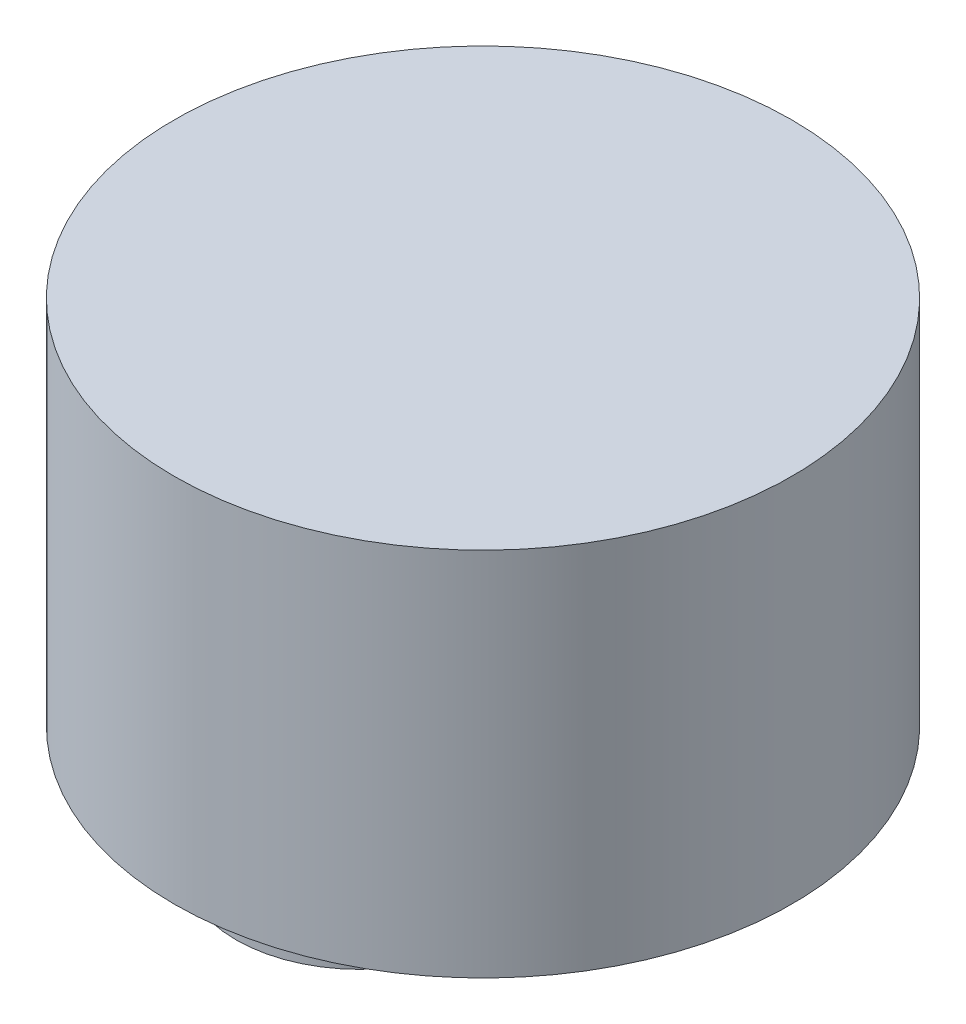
ISO-10303-21;
HEADER;
FILE_DESCRIPTION(('STEP AP214'),'2;1');
FILE_NAME('part.step','',(''),(''),'','','');
FILE_SCHEMA(('AUTOMOTIVE_DESIGN { 1 0 10303 214 1 1 1 1 }'));
ENDSEC;
DATA;
#1=APPLICATION_CONTEXT('core data for automotive mechanical design processes');
#2=APPLICATION_PROTOCOL_DEFINITION('international standard','automotive_design',2000,#1);
#3=PRODUCT_CONTEXT('',#1,'mechanical');
#4=PRODUCT('Part','Part','',(#3));
#5=PRODUCT_RELATED_PRODUCT_CATEGORY('part','',(#4));
#6=PRODUCT_DEFINITION_FORMATION('','',#4);
#7=PRODUCT_DEFINITION_CONTEXT('part definition',#1,'design');
#8=PRODUCT_DEFINITION('design','',#6,#7);
#9=PRODUCT_DEFINITION_SHAPE('','',#8);
#10=(LENGTH_UNIT() NAMED_UNIT(*) SI_UNIT(.MILLI.,.METRE.));
#11=(NAMED_UNIT(*) PLANE_ANGLE_UNIT() SI_UNIT($,.RADIAN.));
#12=(NAMED_UNIT(*) SI_UNIT($,.STERADIAN.) SOLID_ANGLE_UNIT());
#13=UNCERTAINTY_MEASURE_WITH_UNIT(LENGTH_MEASURE(1.E-05),#10,'distance_accuracy_value','');
#14=(GEOMETRIC_REPRESENTATION_CONTEXT(3) GLOBAL_UNCERTAINTY_ASSIGNED_CONTEXT((#13)) GLOBAL_UNIT_ASSIGNED_CONTEXT((#10,
#11,#12)) REPRESENTATION_CONTEXT('',''));
#15=CARTESIAN_POINT('',(0.,0.,0.));
#16=DIRECTION('',(0.,0.,1.));
#17=DIRECTION('',(1.,0.,0.));
#18=AXIS2_PLACEMENT_3D('',#15,#16,#17);
#19=CARTESIAN_POINT('',(0.,0.,0.));
#20=DIRECTION('',(0.,1.,0.));
#21=DIRECTION('',(0.,0.,1.));
#22=AXIS2_PLACEMENT_3D('',#19,#20,#21);
#23=PLANE('',#22);
#24=CARTESIAN_POINT('',(0.,0.,0.));
#25=DIRECTION('',(0.,1.,0.));
#26=DIRECTION('',(0.,0.,1.));
#27=AXIS2_PLACEMENT_3D('',#24,#25,#26);
#28=CIRCLE('',#27,2.5);
#29=CARTESIAN_POINT('',(0.,0.,2.5));
#30=VERTEX_POINT('',#29);
#31=EDGE_CURVE('E41',#30,#30,#28,.T.);
#32=ORIENTED_EDGE('',*,*,#31,.F.);
#33=EDGE_LOOP('',(#32));
#34=FACE_BOUND('',#33,.T.);
#35=CARTESIAN_POINT('',(-1.,0.,0.));
#36=DIRECTION('',(0.,1.,0.));
#37=DIRECTION('',(0.,0.,1.));
#38=AXIS2_PLACEMENT_3D('',#35,#36,#37);
#39=CIRCLE('',#38,1.);
#40=CARTESIAN_POINT('',(-1.,0.,1.));
#41=VERTEX_POINT('',#40);
#42=EDGE_CURVE('E10',#41,#41,#39,.F.);
#43=ORIENTED_EDGE('',*,*,#42,.F.);
#44=EDGE_LOOP('',(#43));
#45=FACE_BOUND('',#44,.T.);
#46=ADVANCED_FACE('F30',(#34,#45),#23,.F.);
#47=CARTESIAN_POINT('',(0.,3.,0.));
#48=DIRECTION('',(0.,-1.,0.));
#49=DIRECTION('',(0.,0.,-1.));
#50=AXIS2_PLACEMENT_3D('',#47,#48,#49);
#51=CYLINDRICAL_SURFACE('',#50,2.5);
#52=CARTESIAN_POINT('',(0.,3.,0.));
#53=DIRECTION('',(0.,1.,0.));
#54=DIRECTION('',(0.,0.,1.));
#55=AXIS2_PLACEMENT_3D('',#52,#53,#54);
#56=CIRCLE('',#55,2.5);
#57=CARTESIAN_POINT('',(0.,3.,2.5));
#58=VERTEX_POINT('',#57);
#59=EDGE_CURVE('E37',#58,#58,#56,.T.);
#60=ORIENTED_EDGE('',*,*,#59,.F.);
#61=EDGE_LOOP('',(#60));
#62=FACE_BOUND('',#61,.T.);
#63=ORIENTED_EDGE('',*,*,#31,.T.);
#64=EDGE_LOOP('',(#63));
#65=FACE_BOUND('',#64,.T.);
#66=ADVANCED_FACE('F32',(#62,#65),#51,.T.);
#67=CARTESIAN_POINT('',(0.,3.,0.));
#68=DIRECTION('',(0.,1.,0.));
#69=DIRECTION('',(0.,0.,1.));
#70=AXIS2_PLACEMENT_3D('',#67,#68,#69);
#71=PLANE('',#70);
#72=ORIENTED_EDGE('',*,*,#59,.T.);
#73=EDGE_LOOP('',(#72));
#74=FACE_BOUND('',#73,.T.);
#75=ADVANCED_FACE('F55',(#74),#71,.T.);
#76=CARTESIAN_POINT('',(-1.,-1.5,0.));
#77=DIRECTION('',(0.,1.,0.));
#78=DIRECTION('',(0.,0.,1.));
#79=AXIS2_PLACEMENT_3D('',#76,#77,#78);
#80=CYLINDRICAL_SURFACE('',#79,1.);
#81=CARTESIAN_POINT('',(-1.,-1.5,0.));
#82=DIRECTION('',(0.,-1.,0.));
#83=DIRECTION('',(0.,0.,-1.));
#84=AXIS2_PLACEMENT_3D('',#81,#82,#83);
#85=CIRCLE('',#84,1.);
#86=CARTESIAN_POINT('',(-1.,-1.5,-1.));
#87=VERTEX_POINT('',#86);
#88=EDGE_CURVE('E46',#87,#87,#85,.T.);
#89=ORIENTED_EDGE('',*,*,#88,.F.);
#90=EDGE_LOOP('',(#89));
#91=FACE_BOUND('',#90,.T.);
#92=ORIENTED_EDGE('',*,*,#42,.T.);
#93=EDGE_LOOP('',(#92));
#94=FACE_BOUND('',#93,.T.);
#95=ADVANCED_FACE('F53',(#91,#94),#80,.T.);
#96=CARTESIAN_POINT('',(-1.,-1.5,0.));
#97=DIRECTION('',(0.,-1.,0.));
#98=DIRECTION('',(0.,0.,-1.));
#99=AXIS2_PLACEMENT_3D('',#96,#97,#98);
#100=PLANE('',#99);
#101=ORIENTED_EDGE('',*,*,#88,.T.);
#102=EDGE_LOOP('',(#101));
#103=FACE_BOUND('',#102,.T.);
#104=ADVANCED_FACE('F51',(#103),#100,.T.);
#105=CLOSED_SHELL('',(#46,#66,#75,#95,#104));
#106=MANIFOLD_SOLID_BREP('B2',#105);
#107=ADVANCED_BREP_SHAPE_REPRESENTATION('',(#18,#106),#14);
#108=SHAPE_DEFINITION_REPRESENTATION(#9,#107);
ENDSEC;
END-ISO-10303-21;
